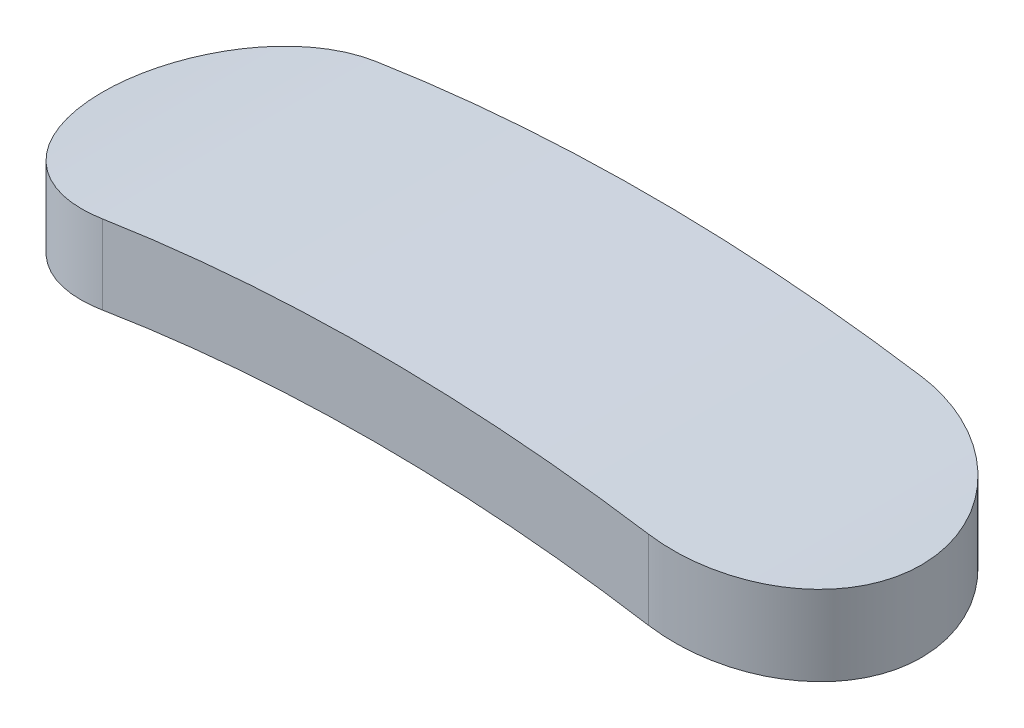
ISO-10303-21;
HEADER;
FILE_DESCRIPTION(('STEP AP214'),'2;1');
FILE_NAME('part.step','',(''),(''),'','','');
FILE_SCHEMA(('AUTOMOTIVE_DESIGN { 1 0 10303 214 1 1 1 1 }'));
ENDSEC;
DATA;
#1=APPLICATION_CONTEXT('core data for automotive mechanical design processes');
#2=APPLICATION_PROTOCOL_DEFINITION('international standard','automotive_design',2000,#1);
#3=PRODUCT_CONTEXT('',#1,'mechanical');
#4=PRODUCT('Part','Part','',(#3));
#5=PRODUCT_RELATED_PRODUCT_CATEGORY('part','',(#4));
#6=PRODUCT_DEFINITION_FORMATION('','',#4);
#7=PRODUCT_DEFINITION_CONTEXT('part definition',#1,'design');
#8=PRODUCT_DEFINITION('design','',#6,#7);
#9=PRODUCT_DEFINITION_SHAPE('','',#8);
#10=(LENGTH_UNIT() NAMED_UNIT(*) SI_UNIT(.MILLI.,.METRE.));
#11=(NAMED_UNIT(*) PLANE_ANGLE_UNIT() SI_UNIT($,.RADIAN.));
#12=(NAMED_UNIT(*) SI_UNIT($,.STERADIAN.) SOLID_ANGLE_UNIT());
#13=UNCERTAINTY_MEASURE_WITH_UNIT(LENGTH_MEASURE(1.E-05),#10,'distance_accuracy_value','');
#14=(GEOMETRIC_REPRESENTATION_CONTEXT(3) GLOBAL_UNCERTAINTY_ASSIGNED_CONTEXT((#13)) GLOBAL_UNIT_ASSIGNED_CONTEXT((#10,
#11,#12)) REPRESENTATION_CONTEXT('',''));
#15=CARTESIAN_POINT('',(0.,0.,0.));
#16=DIRECTION('',(0.,0.,1.));
#17=DIRECTION('',(1.,0.,0.));
#18=AXIS2_PLACEMENT_3D('',#15,#16,#17);
#19=CARTESIAN_POINT('',(-3.5,30.,10.2246672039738));
#20=DIRECTION('',(0.,-1.,0.));
#21=DIRECTION('',(0.,0.,-1.));
#22=AXIS2_PLACEMENT_3D('',#19,#20,#21);
#23=CYLINDRICAL_SURFACE('',#22,1.75);
#24=DIRECTION('',(0.,-1.,0.));
#25=VECTOR('',#24,1.);
#26=CARTESIAN_POINT('',(-3.5,30.,8.47466720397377));
#27=LINE('',#26,#25);
#28=CARTESIAN_POINT('',(-3.5,22.5297580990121,8.47466720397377));
#29=VERTEX_POINT('',#28);
#30=CARTESIAN_POINT('',(-3.5,21.5172024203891,8.47466720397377));
#31=VERTEX_POINT('',#30);
#32=EDGE_CURVE('E87',#29,#31,#27,.T.);
#33=ORIENTED_EDGE('',*,*,#32,.T.);
#34=CARTESIAN_POINT('',(-3.5,21.5172024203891,8.47466720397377));
#35=CARTESIAN_POINT('',(-3.55004357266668,21.5090633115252,8.4746677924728));
#36=CARTESIAN_POINT('',(-3.600033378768,21.5007515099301,8.47681502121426));
#37=CARTESIAN_POINT('',(-3.69959437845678,21.4838438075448,8.48536822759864));
#38=CARTESIAN_POINT('',(-3.74916560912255,21.4752479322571,8.49177382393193));
#39=CARTESIAN_POINT('',(-3.89664671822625,21.4491507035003,8.51730070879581));
#40=CARTESIAN_POINT('',(-3.99348010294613,21.4313142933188,8.54273232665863));
#41=CARTESIAN_POINT('',(-4.18135539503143,21.3954537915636,8.6096699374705));
#42=CARTESIAN_POINT('',(-4.27239576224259,21.3774296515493,8.65118018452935));
#43=CARTESIAN_POINT('',(-4.44618023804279,21.3419621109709,8.74913855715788));
#44=CARTESIAN_POINT('',(-4.52892534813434,21.3245186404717,8.80558487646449));
#45=CARTESIAN_POINT('',(-4.68384515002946,21.2910285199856,8.93198871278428));
#46=CARTESIAN_POINT('',(-4.75600820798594,21.2749834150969,9.00196090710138));
#47=CARTESIAN_POINT('',(-4.88750826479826,21.2451599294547,9.15350762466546));
#48=CARTESIAN_POINT('',(-4.94684474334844,21.2313816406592,9.23508261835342));
#49=CARTESIAN_POINT('',(-5.04994471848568,21.2070938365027,9.40614349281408));
#50=CARTESIAN_POINT('',(-5.09394659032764,21.1965346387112,9.49547851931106));
#51=CARTESIAN_POINT('',(-5.1662471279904,21.1790293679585,9.680617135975));
#52=CARTESIAN_POINT('',(-5.19454940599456,21.1720824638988,9.7764192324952));
#53=CARTESIAN_POINT('',(-5.23394643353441,21.1623771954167,9.96905217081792));
#54=CARTESIAN_POINT('',(-5.24547665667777,21.1595128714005,10.0657887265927));
#55=CARTESIAN_POINT('',(-5.25233745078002,21.1578109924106,10.2598667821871));
#56=CARTESIAN_POINT('',(-5.24766949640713,21.1589730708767,10.3572082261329));
#57=CARTESIAN_POINT('',(-5.22249486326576,21.1652003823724,10.548154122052));
#58=CARTESIAN_POINT('',(-5.20223329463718,21.1702052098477,10.6417930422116));
#59=CARTESIAN_POINT('',(-5.14683083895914,21.1837423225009,10.8242858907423));
#60=CARTESIAN_POINT('',(-5.11168950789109,21.1922747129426,10.9131396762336));
#61=CARTESIAN_POINT('',(-5.02725233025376,21.2124639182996,11.0844340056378));
#62=CARTESIAN_POINT('',(-4.97783481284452,21.2241475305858,11.1668113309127));
#63=CARTESIAN_POINT('',(-4.8664460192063,21.2499638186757,11.3221471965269));
#64=CARTESIAN_POINT('',(-4.80447381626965,21.2640966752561,11.3951050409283));
#65=CARTESIAN_POINT('',(-4.66802555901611,21.2944718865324,11.5314763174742));
#66=CARTESIAN_POINT('',(-4.59327668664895,21.3107579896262,11.5946070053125));
#67=CARTESIAN_POINT('',(-4.43445099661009,21.3443722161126,11.7075015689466));
#68=CARTESIAN_POINT('',(-4.35037000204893,21.3617008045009,11.757259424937));
#69=CARTESIAN_POINT('',(-4.17322636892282,21.397021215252,11.8430524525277));
#70=CARTESIAN_POINT('',(-4.08000573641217,21.4150192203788,11.8787583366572));
#71=CARTESIAN_POINT('',(-3.88885374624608,21.4505529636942,11.9338053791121));
#72=CARTESIAN_POINT('',(-3.79092978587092,21.4680893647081,11.9531713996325));
#73=CARTESIAN_POINT('',(-3.66020837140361,21.4905545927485,11.9676156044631));
#74=CARTESIAN_POINT('',(-3.62821139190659,21.4959797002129,11.9702603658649));
#75=CARTESIAN_POINT('',(-3.56415119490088,21.506693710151,11.9737838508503));
#76=CARTESIAN_POINT('',(-3.53208816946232,21.5119828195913,11.974665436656));
#77=CARTESIAN_POINT('',(-3.5,21.5172024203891,11.9746672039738));
#78=B_SPLINE_CURVE_WITH_KNOTS('',3,(#34,#35,#36,#37,#38,#39,#40,#41,#42,#43,#44,#45,#46,#47,#48,
#49,#50,#51,#52,#53,#54,#55,#56,#57,#58,#59,#60,#61,#62,#63,#64,#65,#66,#67,#68,#69,#70,#71,#72,
#73,#74,#75,#76,#77),.UNSPECIFIED.,.F.,.F.,(4,2,2,2,2,2,2,2,2,2,2,2,2,2,2,2,2,2,2,2,2,4),(0.,
0.152007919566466,0.304002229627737,0.607522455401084,0.911123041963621,1.21468692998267,
1.51858209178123,1.82248957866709,2.12143667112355,2.42031495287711,2.711285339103,
3.00222923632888,3.28869101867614,3.57516134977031,3.86414907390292,4.15315813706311,
4.44936032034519,4.74569561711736,5.0486118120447,5.35106626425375,5.44871544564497,
5.54620598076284),.UNSPECIFIED.);
#79=CARTESIAN_POINT('',(-3.5,21.5172024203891,11.9746672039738));
#80=VERTEX_POINT('',#79);
#81=EDGE_CURVE('E96',#31,#80,#78,.T.);
#82=ORIENTED_EDGE('',*,*,#81,.T.);
#83=DIRECTION('',(0.,-1.,0.));
#84=VECTOR('',#83,1.);
#85=CARTESIAN_POINT('',(-3.5,30.,11.9746672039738));
#86=LINE('',#85,#84);
#87=CARTESIAN_POINT('',(-3.5,22.5297580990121,11.9746672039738));
#88=VERTEX_POINT('',#87);
#89=EDGE_CURVE('E92',#88,#80,#86,.T.);
#90=ORIENTED_EDGE('',*,*,#89,.F.);
#91=CARTESIAN_POINT('',(-3.5,22.5297580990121,8.47466720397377));
#92=CARTESIAN_POINT('',(-3.54997243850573,22.5219958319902,8.47466776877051));
#93=CARTESIAN_POINT('',(-3.59989383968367,22.5140690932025,8.47680893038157));
#94=CARTESIAN_POINT('',(-3.69932403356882,22.4979450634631,8.4853391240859));
#95=CARTESIAN_POINT('',(-3.74883286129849,22.489747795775,8.49172779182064));
#96=CARTESIAN_POINT('',(-3.89613581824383,22.4648613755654,8.51718938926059));
#97=CARTESIAN_POINT('',(-3.99286266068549,22.4478532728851,8.542558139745));
#98=CARTESIAN_POINT('',(-4.18054999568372,22.4136594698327,8.60933745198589));
#99=CARTESIAN_POINT('',(-4.27150884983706,22.396473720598,8.6507525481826));
#100=CARTESIAN_POINT('',(-4.44515024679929,22.3626577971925,8.74848652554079));
#101=CARTESIAN_POINT('',(-4.52783385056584,22.346027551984,8.80480349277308));
#102=CARTESIAN_POINT('',(-4.68264470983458,22.3141010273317,8.93090151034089));
#103=CARTESIAN_POINT('',(-4.75476154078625,22.2988060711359,9.00069570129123));
#104=CARTESIAN_POINT('',(-4.88620593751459,22.2703732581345,9.15183858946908));
#105=CARTESIAN_POINT('',(-4.94553285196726,22.2572355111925,9.23318787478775));
#106=CARTESIAN_POINT('',(-5.04874370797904,22.2340494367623,9.40387996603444));
#107=CARTESIAN_POINT('',(-5.09284432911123,22.22395804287,9.49308579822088));
#108=CARTESIAN_POINT('',(-5.1653699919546,22.2072138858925,9.67795308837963));
#109=CARTESIAN_POINT('',(-5.19379838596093,22.2005603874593,9.77361316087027));
#110=CARTESIAN_POINT('',(-5.23353058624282,22.1912272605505,9.96619901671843));
#111=CARTESIAN_POINT('',(-5.24523080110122,22.1884556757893,10.0630386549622));
#112=CARTESIAN_POINT('',(-5.25239301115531,22.1867614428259,10.2573474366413));
#113=CARTESIAN_POINT('',(-5.24785633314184,22.1878384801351,10.3548165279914));
#114=CARTESIAN_POINT('',(-5.2228804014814,22.1937305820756,10.5461685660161));
#115=CARTESIAN_POINT('',(-5.20266651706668,22.1984926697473,10.6400827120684));
#116=CARTESIAN_POINT('',(-5.14726506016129,22.2114039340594,10.8231345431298));
#117=CARTESIAN_POINT('',(-5.11207709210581,22.2195532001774,10.9122721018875));
#118=CARTESIAN_POINT('',(-5.02748135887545,22.2388470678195,11.0840507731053));
#119=CARTESIAN_POINT('',(-4.97796303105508,22.2500149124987,11.1666347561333));
#120=CARTESIAN_POINT('',(-4.86629186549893,22.2747045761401,11.3223599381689));
#121=CARTESIAN_POINT('',(-4.80413822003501,22.2882265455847,11.3955005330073));
#122=CARTESIAN_POINT('',(-4.66739847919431,22.3172663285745,11.5320410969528));
#123=CARTESIAN_POINT('',(-4.59256239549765,22.3328224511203,11.5951825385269));
#124=CARTESIAN_POINT('',(-4.43354170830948,22.3649341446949,11.7080793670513));
#125=CARTESIAN_POINT('',(-4.34935302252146,22.3814901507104,11.7578288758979));
#126=CARTESIAN_POINT('',(-4.17214987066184,22.4152060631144,11.8434942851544));
#127=CARTESIAN_POINT('',(-4.07899074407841,22.4323714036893,11.8791083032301));
#128=CARTESIAN_POINT('',(-3.88798648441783,22.4662619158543,11.9339970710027));
#129=CARTESIAN_POINT('',(-3.79014871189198,22.4829877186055,11.9532966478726));
#130=CARTESIAN_POINT('',(-3.65963740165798,22.5044019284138,11.9676659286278));
#131=CARTESIAN_POINT('',(-3.62775261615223,22.5095637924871,11.9702919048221));
#132=CARTESIAN_POINT('',(-3.56391975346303,22.51975830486,11.9737902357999));
#133=CARTESIAN_POINT('',(-3.53197186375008,22.5247911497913,11.974665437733));
#134=CARTESIAN_POINT('',(-3.5,22.5297580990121,11.9746672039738));
#135=B_SPLINE_CURVE_WITH_KNOTS('',3,(#91,#92,#93,#94,#95,#96,#97,#98,#99,#100,#101,#102,#103,
#104,#105,#106,#107,#108,#109,#110,#111,#112,#113,#114,#115,#116,#117,#118,#119,#120,#121,#122,
#123,#124,#125,#126,#127,#128,#129,#130,#131,#132,#133,#134),.UNSPECIFIED.,.F.,.F.,(4,2,2,2,2,2,
2,2,2,2,2,2,2,2,2,2,2,2,2,2,2,4),(0.,0.151620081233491,0.303227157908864,0.605972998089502,
0.908804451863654,1.21159703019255,1.51468634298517,1.81779108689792,2.11638510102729,
2.41491522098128,2.70624664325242,2.99755426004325,3.28475006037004,3.57195344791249,
3.86143461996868,4.15093430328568,4.44699957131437,4.74319457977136,5.045412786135,
5.34717024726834,5.44435562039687,5.54138281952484),.UNSPECIFIED.);
#136=EDGE_CURVE('E11',#29,#88,#135,.T.);
#137=ORIENTED_EDGE('',*,*,#136,.F.);
#138=EDGE_LOOP('',(#33,#82,#90,#137));
#139=FACE_BOUND('',#138,.T.);
#140=ADVANCED_FACE('F39',(#139),#23,.T.);
#141=CARTESIAN_POINT('',(-3.5,30.,11.9746672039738));
#142=DIRECTION('',(0.,0.,-1.));
#143=DIRECTION('',(-1.,0.,0.));
#144=AXIS2_PLACEMENT_3D('',#141,#142,#143);
#145=PLANE('',#144);
#146=ORIENTED_EDGE('',*,*,#89,.T.);
#147=CARTESIAN_POINT('',(0.,0.,11.9746672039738));
#148=DIRECTION('',(0.,0.,-1.));
#149=DIRECTION('',(-1.,0.,0.));
#150=AXIS2_PLACEMENT_3D('',#147,#148,#149);
#151=CIRCLE('',#150,21.8);
#152=CARTESIAN_POINT('',(3.5,21.5172024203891,11.9746672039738));
#153=VERTEX_POINT('',#152);
#154=EDGE_CURVE('E100',#80,#153,#151,.T.);
#155=ORIENTED_EDGE('',*,*,#154,.T.);
#156=DIRECTION('',(0.,-1.,0.));
#157=VECTOR('',#156,1.);
#158=CARTESIAN_POINT('',(3.5,30.,11.9746672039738));
#159=LINE('',#158,#157);
#160=CARTESIAN_POINT('',(3.5,22.5297580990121,11.9746672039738));
#161=VERTEX_POINT('',#160);
#162=EDGE_CURVE('E138',#161,#153,#159,.T.);
#163=ORIENTED_EDGE('',*,*,#162,.F.);
#164=CARTESIAN_POINT('',(0.,0.,11.9746672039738));
#165=DIRECTION('',(0.,0.,-1.));
#166=DIRECTION('',(-1.,0.,0.));
#167=AXIS2_PLACEMENT_3D('',#164,#165,#166);
#168=CIRCLE('',#167,22.8);
#169=EDGE_CURVE('E53',#88,#161,#168,.T.);
#170=ORIENTED_EDGE('',*,*,#169,.F.);
#171=EDGE_LOOP('',(#146,#155,#163,#170));
#172=FACE_BOUND('',#171,.T.);
#173=ADVANCED_FACE('F115',(#172),#145,.F.);
#174=CARTESIAN_POINT('',(3.5,30.,10.2246672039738));
#175=DIRECTION('',(0.,-1.,0.));
#176=DIRECTION('',(0.,0.,-1.));
#177=AXIS2_PLACEMENT_3D('',#174,#175,#176);
#178=CYLINDRICAL_SURFACE('',#177,1.75);
#179=ORIENTED_EDGE('',*,*,#162,.T.);
#180=CARTESIAN_POINT('',(3.5,21.5172024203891,11.9746672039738));
#181=CARTESIAN_POINT('',(3.55004357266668,21.5090633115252,11.9746666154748));
#182=CARTESIAN_POINT('',(3.600033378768,21.5007515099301,11.9725193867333));
#183=CARTESIAN_POINT('',(3.69959437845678,21.4838438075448,11.9639661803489));
#184=CARTESIAN_POINT('',(3.74916560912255,21.4752479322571,11.9575605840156));
#185=CARTESIAN_POINT('',(3.89664671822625,21.4491507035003,11.9320336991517));
#186=CARTESIAN_POINT('',(3.99348010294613,21.4313142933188,11.9066020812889));
#187=CARTESIAN_POINT('',(4.18135539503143,21.3954537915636,11.8396644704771));
#188=CARTESIAN_POINT('',(4.27239576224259,21.3774296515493,11.7981542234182));
#189=CARTESIAN_POINT('',(4.44618023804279,21.3419621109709,11.7001958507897));
#190=CARTESIAN_POINT('',(4.52892534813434,21.3245186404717,11.6437495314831));
#191=CARTESIAN_POINT('',(4.68384515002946,21.2910285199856,11.5173456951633));
#192=CARTESIAN_POINT('',(4.75600820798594,21.2749834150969,11.4473735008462));
#193=CARTESIAN_POINT('',(4.88750826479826,21.2451599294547,11.2958267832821));
#194=CARTESIAN_POINT('',(4.94684474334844,21.2313816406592,11.2142517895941));
#195=CARTESIAN_POINT('',(5.04994471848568,21.2070938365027,11.0431909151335));
#196=CARTESIAN_POINT('',(5.09394659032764,21.1965346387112,10.9538558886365));
#197=CARTESIAN_POINT('',(5.1662471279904,21.1790293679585,10.7687172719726));
#198=CARTESIAN_POINT('',(5.19454940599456,21.1720824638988,10.6729151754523));
#199=CARTESIAN_POINT('',(5.23394643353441,21.1623771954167,10.4802822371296));
#200=CARTESIAN_POINT('',(5.24547665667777,21.1595128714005,10.3835456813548));
#201=CARTESIAN_POINT('',(5.25233745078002,21.1578109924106,10.1894676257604));
#202=CARTESIAN_POINT('',(5.24766949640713,21.1589730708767,10.0921261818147));
#203=CARTESIAN_POINT('',(5.22249486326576,21.1652003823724,9.90118028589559));
#204=CARTESIAN_POINT('',(5.20223329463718,21.1702052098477,9.80754136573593));
#205=CARTESIAN_POINT('',(5.14683083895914,21.1837423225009,9.62504851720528));
#206=CARTESIAN_POINT('',(5.11168950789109,21.1922747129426,9.53619473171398));
#207=CARTESIAN_POINT('',(5.02725233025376,21.2124639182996,9.36490040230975));
#208=CARTESIAN_POINT('',(4.97783481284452,21.2241475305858,9.28252307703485));
#209=CARTESIAN_POINT('',(4.8664460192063,21.2499638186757,9.12718721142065));
#210=CARTESIAN_POINT('',(4.80447381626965,21.2640966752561,9.05422936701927));
#211=CARTESIAN_POINT('',(4.66802555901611,21.2944718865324,8.91785809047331));
#212=CARTESIAN_POINT('',(4.59327668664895,21.3107579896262,8.8547274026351));
#213=CARTESIAN_POINT('',(4.43445099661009,21.3443722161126,8.74183283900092));
#214=CARTESIAN_POINT('',(4.35037000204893,21.3617008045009,8.69207498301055));
#215=CARTESIAN_POINT('',(4.17322636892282,21.397021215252,8.60628195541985));
#216=CARTESIAN_POINT('',(4.08000573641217,21.4150192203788,8.57057607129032));
#217=CARTESIAN_POINT('',(3.88885374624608,21.4505529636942,8.51552902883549));
#218=CARTESIAN_POINT('',(3.79092978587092,21.4680893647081,8.49616300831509));
#219=CARTESIAN_POINT('',(3.66020837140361,21.4905545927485,8.48171880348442));
#220=CARTESIAN_POINT('',(3.62821139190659,21.4959797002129,8.47907404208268));
#221=CARTESIAN_POINT('',(3.56415119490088,21.506693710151,8.47555055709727));
#222=CARTESIAN_POINT('',(3.53208816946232,21.5119828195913,8.47466897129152));
#223=CARTESIAN_POINT('',(3.5,21.5172024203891,8.47466720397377));
#224=B_SPLINE_CURVE_WITH_KNOTS('',3,(#180,#181,#182,#183,#184,#185,#186,#187,#188,#189,#190,
#191,#192,#193,#194,#195,#196,#197,#198,#199,#200,#201,#202,#203,#204,#205,#206,#207,#208,#209,
#210,#211,#212,#213,#214,#215,#216,#217,#218,#219,#220,#221,#222,#223),.UNSPECIFIED.,.F.,.F.,(4,
2,2,2,2,2,2,2,2,2,2,2,2,2,2,2,2,2,2,2,2,4),(0.,0.152007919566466,0.304002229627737,
0.607522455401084,0.911123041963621,1.21468692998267,1.51858209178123,1.82248957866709,
2.12143667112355,2.42031495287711,2.711285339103,3.00222923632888,3.28869101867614,
3.57516134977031,3.86414907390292,4.15315813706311,4.44936032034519,4.74569561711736,
5.0486118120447,5.35106626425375,5.44871544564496,5.54620598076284),.UNSPECIFIED.);
#225=CARTESIAN_POINT('',(3.5,21.5172024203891,8.47466720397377));
#226=VERTEX_POINT('',#225);
#227=EDGE_CURVE('E91',#153,#226,#224,.T.);
#228=ORIENTED_EDGE('',*,*,#227,.T.);
#229=DIRECTION('',(0.,-1.,0.));
#230=VECTOR('',#229,1.);
#231=CARTESIAN_POINT('',(3.5,30.,8.47466720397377));
#232=LINE('',#231,#230);
#233=CARTESIAN_POINT('',(3.5,22.5297580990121,8.47466720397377));
#234=VERTEX_POINT('',#233);
#235=EDGE_CURVE('E60',#234,#226,#232,.T.);
#236=ORIENTED_EDGE('',*,*,#235,.F.);
#237=CARTESIAN_POINT('',(3.5,22.5297580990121,11.9746672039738));
#238=CARTESIAN_POINT('',(3.54997243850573,22.5219958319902,11.974666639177));
#239=CARTESIAN_POINT('',(3.59989383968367,22.5140690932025,11.972525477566));
#240=CARTESIAN_POINT('',(3.69932403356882,22.4979450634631,11.9639952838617));
#241=CARTESIAN_POINT('',(3.74883286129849,22.489747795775,11.9576066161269));
#242=CARTESIAN_POINT('',(3.89613581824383,22.4648613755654,11.932145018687));
#243=CARTESIAN_POINT('',(3.99286266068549,22.4478532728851,11.9067762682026));
#244=CARTESIAN_POINT('',(4.18054999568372,22.4136594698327,11.8399969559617));
#245=CARTESIAN_POINT('',(4.27150884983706,22.396473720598,11.798581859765));
#246=CARTESIAN_POINT('',(4.44515024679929,22.3626577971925,11.7008478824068));
#247=CARTESIAN_POINT('',(4.52783385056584,22.346027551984,11.6445309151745));
#248=CARTESIAN_POINT('',(4.68264470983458,22.3141010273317,11.5184328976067));
#249=CARTESIAN_POINT('',(4.75476154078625,22.2988060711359,11.4486387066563));
#250=CARTESIAN_POINT('',(4.88620593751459,22.2703732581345,11.2974958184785));
#251=CARTESIAN_POINT('',(4.94553285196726,22.2572355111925,11.2161465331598));
#252=CARTESIAN_POINT('',(5.04874370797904,22.2340494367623,11.0454544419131));
#253=CARTESIAN_POINT('',(5.09284432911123,22.22395804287,10.9562486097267));
#254=CARTESIAN_POINT('',(5.1653699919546,22.2072138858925,10.7713813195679));
#255=CARTESIAN_POINT('',(5.19379838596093,22.2005603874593,10.6757212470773));
#256=CARTESIAN_POINT('',(5.23353058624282,22.1912272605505,10.4831353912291));
#257=CARTESIAN_POINT('',(5.24523080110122,22.1884556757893,10.3862957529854));
#258=CARTESIAN_POINT('',(5.25239301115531,22.1867614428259,10.1919869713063));
#259=CARTESIAN_POINT('',(5.24785633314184,22.1878384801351,10.0945178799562));
#260=CARTESIAN_POINT('',(5.2228804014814,22.1937305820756,9.90316584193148));
#261=CARTESIAN_POINT('',(5.20266651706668,22.1984926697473,9.80925169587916));
#262=CARTESIAN_POINT('',(5.14726506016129,22.2114039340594,9.62619986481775));
#263=CARTESIAN_POINT('',(5.11207709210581,22.2195532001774,9.53706230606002));
#264=CARTESIAN_POINT('',(5.02748135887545,22.2388470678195,9.36528363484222));
#265=CARTESIAN_POINT('',(4.97796303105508,22.2500149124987,9.28269965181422));
#266=CARTESIAN_POINT('',(4.86629186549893,22.2747045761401,9.12697446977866));
#267=CARTESIAN_POINT('',(4.80413822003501,22.2882265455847,9.05383387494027));
#268=CARTESIAN_POINT('',(4.66739847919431,22.3172663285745,8.91729331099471));
#269=CARTESIAN_POINT('',(4.59256239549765,22.3328224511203,8.8541518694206));
#270=CARTESIAN_POINT('',(4.43354170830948,22.3649341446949,8.74125504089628));
#271=CARTESIAN_POINT('',(4.34935302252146,22.3814901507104,8.69150553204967));
#272=CARTESIAN_POINT('',(4.17214987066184,22.4152060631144,8.60584012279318));
#273=CARTESIAN_POINT('',(4.07899074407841,22.4323714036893,8.57022610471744));
#274=CARTESIAN_POINT('',(3.88798648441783,22.4662619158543,8.51533733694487));
#275=CARTESIAN_POINT('',(3.79014871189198,22.4829877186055,8.49603776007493));
#276=CARTESIAN_POINT('',(3.65963740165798,22.5044019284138,8.48166847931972));
#277=CARTESIAN_POINT('',(3.62775261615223,22.5095637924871,8.47904250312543));
#278=CARTESIAN_POINT('',(3.56391975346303,22.51975830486,8.47554417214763));
#279=CARTESIAN_POINT('',(3.53197186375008,22.5247911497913,8.47466897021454));
#280=CARTESIAN_POINT('',(3.5,22.5297580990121,8.47466720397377));
#281=B_SPLINE_CURVE_WITH_KNOTS('',3,(#237,#238,#239,#240,#241,#242,#243,#244,#245,#246,#247,
#248,#249,#250,#251,#252,#253,#254,#255,#256,#257,#258,#259,#260,#261,#262,#263,#264,#265,#266,
#267,#268,#269,#270,#271,#272,#273,#274,#275,#276,#277,#278,#279,#280),.UNSPECIFIED.,.F.,.F.,(4,
2,2,2,2,2,2,2,2,2,2,2,2,2,2,2,2,2,2,2,2,4),(0.,0.151620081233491,0.303227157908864,
0.605972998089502,0.908804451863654,1.21159703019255,1.51468634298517,1.81779108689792,
2.11638510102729,2.41491522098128,2.70624664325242,2.99755426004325,3.28475006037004,
3.57195344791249,3.86143461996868,4.15093430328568,4.44699957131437,4.74319457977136,
5.045412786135,5.34717024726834,5.44435562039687,5.54138281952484),.UNSPECIFIED.);
#282=EDGE_CURVE('E103',#161,#234,#281,.T.);
#283=ORIENTED_EDGE('',*,*,#282,.F.);
#284=EDGE_LOOP('',(#179,#228,#236,#283));
#285=FACE_BOUND('',#284,.T.);
#286=ADVANCED_FACE('F126',(#285),#178,.T.);
#287=CARTESIAN_POINT('',(-3.5,30.,8.47466720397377));
#288=DIRECTION('',(0.,0.,-1.));
#289=DIRECTION('',(-1.,0.,0.));
#290=AXIS2_PLACEMENT_3D('',#287,#288,#289);
#291=PLANE('',#290);
#292=CARTESIAN_POINT('',(0.,0.,8.47466720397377));
#293=DIRECTION('',(0.,0.,-1.));
#294=DIRECTION('',(-1.,0.,0.));
#295=AXIS2_PLACEMENT_3D('',#292,#293,#294);
#296=CIRCLE('',#295,21.8);
#297=EDGE_CURVE('E84',#31,#226,#296,.T.);
#298=ORIENTED_EDGE('',*,*,#297,.F.);
#299=ORIENTED_EDGE('',*,*,#32,.F.);
#300=CARTESIAN_POINT('',(0.,0.,8.47466720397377));
#301=DIRECTION('',(0.,0.,-1.));
#302=DIRECTION('',(-1.,0.,0.));
#303=AXIS2_PLACEMENT_3D('',#300,#301,#302);
#304=CIRCLE('',#303,22.8);
#305=EDGE_CURVE('E101',#29,#234,#304,.T.);
#306=ORIENTED_EDGE('',*,*,#305,.T.);
#307=ORIENTED_EDGE('',*,*,#235,.T.);
#308=EDGE_LOOP('',(#298,#299,#306,#307));
#309=FACE_BOUND('',#308,.T.);
#310=ADVANCED_FACE('F86',(#309),#291,.T.);
#311=CARTESIAN_POINT('',(0.,0.,20.));
#312=DIRECTION('',(0.,0.,-1.));
#313=DIRECTION('',(-1.,0.,0.));
#314=AXIS2_PLACEMENT_3D('',#311,#312,#313);
#315=CYLINDRICAL_SURFACE('',#314,22.8);
#316=ORIENTED_EDGE('',*,*,#305,.F.);
#317=ORIENTED_EDGE('',*,*,#136,.T.);
#318=ORIENTED_EDGE('',*,*,#169,.T.);
#319=ORIENTED_EDGE('',*,*,#282,.T.);
#320=EDGE_LOOP('',(#316,#317,#318,#319));
#321=FACE_BOUND('',#320,.T.);
#322=ADVANCED_FACE('F117',(#321),#315,.T.);
#323=CARTESIAN_POINT('',(0.,0.,20.));
#324=DIRECTION('',(0.,0.,-1.));
#325=DIRECTION('',(-1.,0.,0.));
#326=AXIS2_PLACEMENT_3D('',#323,#324,#325);
#327=CYLINDRICAL_SURFACE('',#326,21.8);
#328=ORIENTED_EDGE('',*,*,#81,.F.);
#329=ORIENTED_EDGE('',*,*,#297,.T.);
#330=ORIENTED_EDGE('',*,*,#227,.F.);
#331=ORIENTED_EDGE('',*,*,#154,.F.);
#332=EDGE_LOOP('',(#328,#329,#330,#331));
#333=FACE_BOUND('',#332,.T.);
#334=ADVANCED_FACE('F41',(#333),#327,.F.);
#335=CLOSED_SHELL('',(#140,#173,#286,#310,#322,#334));
#336=MANIFOLD_SOLID_BREP('B2',#335);
#337=ADVANCED_BREP_SHAPE_REPRESENTATION('',(#18,#336),#14);
#338=SHAPE_DEFINITION_REPRESENTATION(#9,#337);
ENDSEC;
END-ISO-10303-21;
